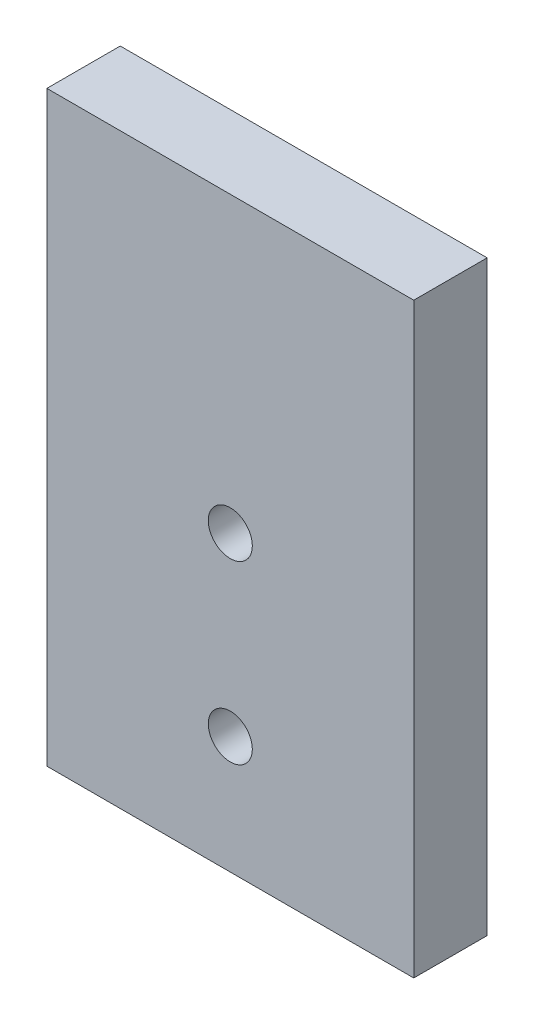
from build123d import *

# Parameters (mm, degrees)
ESQUISSE1_W             = 50
ESQUISSE1_H             = 80
BOSS_EXTRU_1_DEPTH      = 10
ESQUISSE2_R             = 3
ENL_V_MAT_EXTRU_1_DEPTH = 10


with BuildPart() as part:
    # Esquisse1 → Boss.-Extru.1 (new body)
    with BuildSketch(Plane.XY):
        with Locations((25, 40)):
            Rectangle(ESQUISSE1_W, ESQUISSE1_H)
    extrude(amount=BOSS_EXTRU_1_DEPTH)

    # Esquisse2 → Enl_v. mat.-Extru.1 (cut)
    with BuildSketch(Plane.XY.offset(10)):
        with Locations((25, 16)):
            Circle(ESQUISSE2_R)
        with Locations((25, 40)):
            Circle(ESQUISSE2_R)
    extrude(amount=-ENL_V_MAT_EXTRU_1_DEPTH, mode=Mode.SUBTRACT)


solid = part.part
